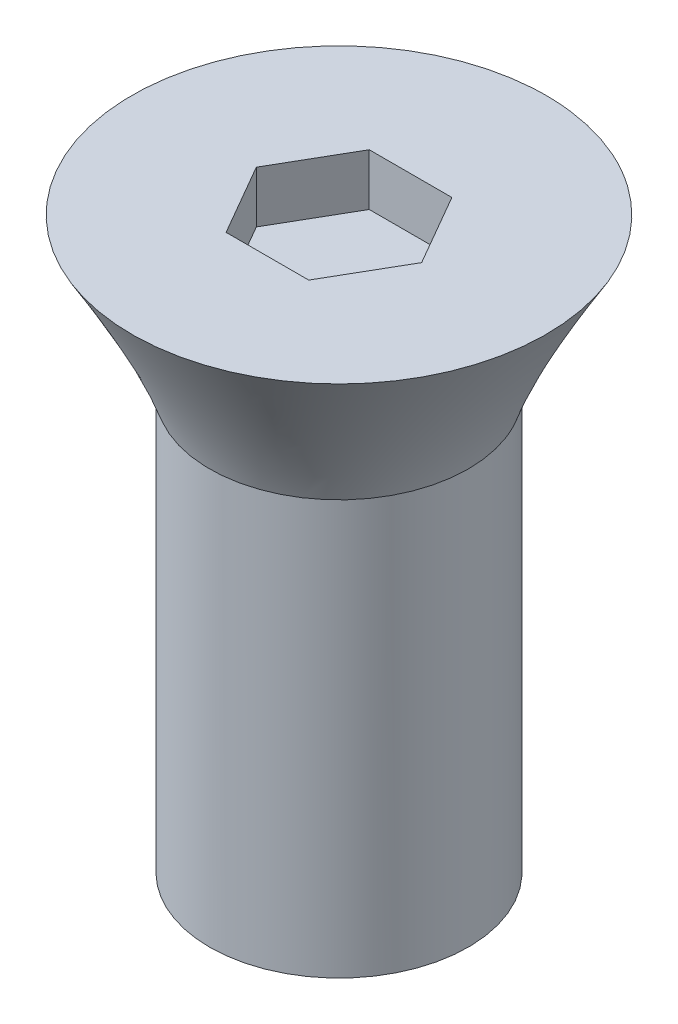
ISO-10303-21;
HEADER;
FILE_DESCRIPTION(('STEP AP214'),'2;1');
FILE_NAME('part.step','',(''),(''),'','','');
FILE_SCHEMA(('AUTOMOTIVE_DESIGN { 1 0 10303 214 1 1 1 1 }'));
ENDSEC;
DATA;
#1=APPLICATION_CONTEXT('core data for automotive mechanical design processes');
#2=APPLICATION_PROTOCOL_DEFINITION('international standard','automotive_design',2000,#1);
#3=PRODUCT_CONTEXT('',#1,'mechanical');
#4=PRODUCT('Part','Part','',(#3));
#5=PRODUCT_RELATED_PRODUCT_CATEGORY('part','',(#4));
#6=PRODUCT_DEFINITION_FORMATION('','',#4);
#7=PRODUCT_DEFINITION_CONTEXT('part definition',#1,'design');
#8=PRODUCT_DEFINITION('design','',#6,#7);
#9=PRODUCT_DEFINITION_SHAPE('','',#8);
#10=(LENGTH_UNIT() NAMED_UNIT(*) SI_UNIT(.MILLI.,.METRE.));
#11=(NAMED_UNIT(*) PLANE_ANGLE_UNIT() SI_UNIT($,.RADIAN.));
#12=(NAMED_UNIT(*) SI_UNIT($,.STERADIAN.) SOLID_ANGLE_UNIT());
#13=UNCERTAINTY_MEASURE_WITH_UNIT(LENGTH_MEASURE(1.E-05),#10,'distance_accuracy_value','');
#14=(GEOMETRIC_REPRESENTATION_CONTEXT(3) GLOBAL_UNCERTAINTY_ASSIGNED_CONTEXT((#13)) GLOBAL_UNIT_ASSIGNED_CONTEXT((#10,
#11,#12)) REPRESENTATION_CONTEXT('',''));
#15=CARTESIAN_POINT('',(0.,0.,0.));
#16=DIRECTION('',(0.,0.,1.));
#17=DIRECTION('',(1.,0.,0.));
#18=AXIS2_PLACEMENT_3D('',#15,#16,#17);
#19=CARTESIAN_POINT('',(4.44089209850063E-13,7.99999999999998,2.22044604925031E-13));
#20=DIRECTION('',(0.,-1.,0.));
#21=DIRECTION('',(0.,0.,-1.));
#22=AXIS2_PLACEMENT_3D('',#19,#20,#21);
#23=CYLINDRICAL_SURFACE('',#22,2.5);
#24=CARTESIAN_POINT('',(4.44089209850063E-13,7.99999999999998,2.22044604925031E-13));
#25=DIRECTION('',(0.,-1.,0.));
#26=DIRECTION('',(0.,0.,-1.));
#27=AXIS2_PLACEMENT_3D('',#24,#25,#26);
#28=CIRCLE('',#27,2.5);
#29=CARTESIAN_POINT('',(-1.74541354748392,7.99999999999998,1.78984120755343));
#30=VERTEX_POINT('',#29);
#31=EDGE_CURVE('E14',#30,#30,#28,.F.);
#32=ORIENTED_EDGE('',*,*,#31,.F.);
#33=EDGE_LOOP('',(#32));
#34=FACE_BOUND('',#33,.T.);
#35=CARTESIAN_POINT('',(0.,0.,0.));
#36=DIRECTION('',(0.,1.,0.));
#37=DIRECTION('',(0.,0.,1.));
#38=AXIS2_PLACEMENT_3D('',#35,#36,#37);
#39=CIRCLE('',#38,2.5);
#40=CARTESIAN_POINT('',(0.,0.,2.50000000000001));
#41=VERTEX_POINT('',#40);
#42=EDGE_CURVE('E58',#41,#41,#39,.T.);
#43=ORIENTED_EDGE('',*,*,#42,.T.);
#44=EDGE_LOOP('',(#43));
#45=FACE_BOUND('',#44,.T.);
#46=ADVANCED_FACE('F50',(#34,#45),#23,.T.);
#47=CARTESIAN_POINT('',(0.,0.,0.));
#48=DIRECTION('',(0.,1.,0.));
#49=DIRECTION('',(0.,0.,1.));
#50=AXIS2_PLACEMENT_3D('',#47,#48,#49);
#51=PLANE('',#50);
#52=ORIENTED_EDGE('',*,*,#42,.F.);
#53=EDGE_LOOP('',(#52));
#54=FACE_BOUND('',#53,.T.);
#55=ADVANCED_FACE('F184',(#54),#51,.F.);
#56=CARTESIAN_POINT('',(3.33066907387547E-13,11.,2.22044604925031E-13));
#57=DIRECTION('',(0.,1.,0.));
#58=DIRECTION('',(0.,0.,1.));
#59=AXIS2_PLACEMENT_3D('',#56,#57,#58);
#60=PLANE('',#59);
#61=DIRECTION('',(-0.499999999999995,0.,0.866025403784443));
#62=VECTOR('',#61,1.);
#63=CARTESIAN_POINT('',(-0.798247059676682,11.,-1.38260446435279));
#64=LINE('',#63,#62);
#65=CARTESIAN_POINT('',(-0.798247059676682,11.,-1.38260446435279));
#66=VERTEX_POINT('',#65);
#67=CARTESIAN_POINT('',(-1.59649411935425,11.,8.88178419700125E-13));
#68=VERTEX_POINT('',#67);
#69=EDGE_CURVE('E66',#66,#68,#64,.T.);
#70=ORIENTED_EDGE('',*,*,#69,.F.);
#71=DIRECTION('',(-1.,0.,0.));
#72=VECTOR('',#71,1.);
#73=CARTESIAN_POINT('',(0.798247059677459,11.,-1.38260446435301));
#74=LINE('',#73,#72);
#75=CARTESIAN_POINT('',(0.798247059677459,11.,-1.38260446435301));
#76=VERTEX_POINT('',#75);
#77=EDGE_CURVE('E149',#76,#66,#74,.T.);
#78=ORIENTED_EDGE('',*,*,#77,.F.);
#79=DIRECTION('',(-0.500000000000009,0.,-0.866025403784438));
#80=VECTOR('',#79,1.);
#81=CARTESIAN_POINT('',(1.59649411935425,11.,1.11022302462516E-12));
#82=LINE('',#81,#80);
#83=CARTESIAN_POINT('',(1.59649411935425,11.,1.11022302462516E-12));
#84=VERTEX_POINT('',#83);
#85=EDGE_CURVE('E147',#84,#76,#82,.T.);
#86=ORIENTED_EDGE('',*,*,#85,.F.);
#87=DIRECTION('',(0.499999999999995,0.,-0.866025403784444));
#88=VECTOR('',#87,1.);
#89=CARTESIAN_POINT('',(0.798247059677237,11.,1.38260446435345));
#90=LINE('',#89,#88);
#91=CARTESIAN_POINT('',(0.798247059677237,11.,1.38260446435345));
#92=VERTEX_POINT('',#91);
#93=EDGE_CURVE('E114',#92,#84,#90,.T.);
#94=ORIENTED_EDGE('',*,*,#93,.F.);
#95=DIRECTION('',(1.,0.,0.));
#96=VECTOR('',#95,1.);
#97=CARTESIAN_POINT('',(-0.798247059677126,11.,1.3826044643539));
#98=LINE('',#97,#96);
#99=CARTESIAN_POINT('',(-0.798247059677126,11.,1.3826044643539));
#100=VERTEX_POINT('',#99);
#101=EDGE_CURVE('E143',#100,#92,#98,.T.);
#102=ORIENTED_EDGE('',*,*,#101,.F.);
#103=DIRECTION('',(0.500000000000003,0.,0.866025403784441));
#104=VECTOR('',#103,1.);
#105=CARTESIAN_POINT('',(-1.59649411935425,11.,8.88178419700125E-13));
#106=LINE('',#105,#104);
#107=EDGE_CURVE('E140',#68,#100,#106,.T.);
#108=ORIENTED_EDGE('',*,*,#107,.F.);
#109=EDGE_LOOP('',(#70,#78,#86,#94,#102,#108));
#110=FACE_BOUND('',#109,.T.);
#111=CARTESIAN_POINT('',(3.33066907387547E-13,11.,2.22044604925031E-13));
#112=DIRECTION('',(0.,1.,0.));
#113=DIRECTION('',(0.,0.,1.));
#114=AXIS2_PLACEMENT_3D('',#111,#112,#113);
#115=CIRCLE('',#114,4.);
#116=CARTESIAN_POINT('',(-1.08697120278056,11.,3.84947965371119));
#117=VERTEX_POINT('',#116);
#118=EDGE_CURVE('E153',#117,#117,#115,.T.);
#119=ORIENTED_EDGE('',*,*,#118,.T.);
#120=EDGE_LOOP('',(#119));
#121=FACE_BOUND('',#120,.T.);
#122=ADVANCED_FACE('F180',(#110,#121),#60,.T.);
#123=CARTESIAN_POINT('',(-1.74541354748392,7.99999999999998,1.78984120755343));
#124=CARTESIAN_POINT('',(-1.08697120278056,11.,3.84947965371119));
#125=CARTESIAN_POINT('',(1.8342688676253,7.99999999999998,5.28066830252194));
#126=CARTESIAN_POINT('',(6.61198810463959,11.,6.02342205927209));
#127=CARTESIAN_POINT('',(5.32509596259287,7.99999999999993,1.70098588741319));
#128=CARTESIAN_POINT('',(8.78593051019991,11.,-1.67553724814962));
#129=CARTESIAN_POINT('',(1.74541354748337,7.99999999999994,-1.78984120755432));
#130=CARTESIAN_POINT('',(1.08697120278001,10.9999999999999,-3.84947965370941));
#131=CARTESIAN_POINT('',(-1.83426886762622,7.99999999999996,-5.28066830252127));
#132=CARTESIAN_POINT('',(-6.61198810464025,10.9999999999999,-6.02342205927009));
#133=CARTESIAN_POINT('',(-5.32509596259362,7.99999999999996,-1.70098588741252));
#134=CARTESIAN_POINT('',(-8.78593051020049,11.,1.67553724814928));
#135=CARTESIAN_POINT('',(-1.74541354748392,7.99999999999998,1.78984120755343));
#136=CARTESIAN_POINT('',(-1.08697120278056,11.,3.84947965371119));
#137=(BOUNDED_SURFACE() B_SPLINE_SURFACE(3,1,((#123,#124),(#125,#126),(#127,#128),(#129,#130),
(#131,#132),(#133,#134),(#135,#136)),.UNSPECIFIED.,.T.,.F.,.F.) B_SPLINE_SURFACE_WITH_KNOTS((4,
3,4),(2,2),(0.,0.5,1.),(0.,1.),
.UNSPECIFIED.) GEOMETRIC_REPRESENTATION_ITEM() RATIONAL_B_SPLINE_SURFACE(((1.,1.),
(0.333333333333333,0.333333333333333),(0.333333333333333,0.333333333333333),(1.,1.),
(0.333333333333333,0.333333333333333),(0.333333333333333,0.333333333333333),(1.,1.))) REPRESENTATION_ITEM('') SURFACE());
#138=CARTESIAN_POINT('',(-1.74541354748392,7.99999999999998,1.78984120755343));
#139=CARTESIAN_POINT('',(-1.73855477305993,8.03124999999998,1.81129577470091));
#140=CARTESIAN_POINT('',(-1.73169599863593,8.06249999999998,1.83275034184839));
#141=CARTESIAN_POINT('',(-1.71797844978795,8.12499999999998,1.87565947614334));
#142=CARTESIAN_POINT('',(-1.71111967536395,8.15624999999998,1.89711404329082));
#143=CARTESIAN_POINT('',(-1.69740212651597,8.21874999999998,1.94002317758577));
#144=CARTESIAN_POINT('',(-1.69054335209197,8.24999999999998,1.96147774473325));
#145=CARTESIAN_POINT('',(-1.67682580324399,8.31249999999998,2.0043868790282));
#146=CARTESIAN_POINT('',(-1.66996702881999,8.34374999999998,2.02584144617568));
#147=CARTESIAN_POINT('',(-1.65624947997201,8.40624999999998,2.06875058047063));
#148=CARTESIAN_POINT('',(-1.64939070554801,8.43749999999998,2.09020514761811));
#149=CARTESIAN_POINT('',(-1.63567315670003,8.49999999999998,2.13311428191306));
#150=CARTESIAN_POINT('',(-1.62881438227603,8.53124999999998,2.15456884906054));
#151=CARTESIAN_POINT('',(-1.61509683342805,8.59374999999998,2.19747798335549));
#152=CARTESIAN_POINT('',(-1.60823805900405,8.62499999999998,2.21893255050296));
#153=CARTESIAN_POINT('',(-1.59452051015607,8.68749999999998,2.26184168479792));
#154=CARTESIAN_POINT('',(-1.58766173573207,8.71874999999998,2.28329625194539));
#155=CARTESIAN_POINT('',(-1.57394418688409,8.78124999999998,2.32620538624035));
#156=CARTESIAN_POINT('',(-1.56708541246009,8.81249999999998,2.34765995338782));
#157=CARTESIAN_POINT('',(-1.55336786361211,8.87499999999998,2.39056908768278));
#158=CARTESIAN_POINT('',(-1.54650908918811,8.90624999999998,2.41202365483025));
#159=CARTESIAN_POINT('',(-1.53279154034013,8.96874999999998,2.45493278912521));
#160=CARTESIAN_POINT('',(-1.52593276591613,8.99999999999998,2.47638735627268));
#161=CARTESIAN_POINT('',(-1.51221521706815,9.06249999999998,2.51929649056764));
#162=CARTESIAN_POINT('',(-1.50535644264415,9.09374999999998,2.54075105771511));
#163=CARTESIAN_POINT('',(-1.49163889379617,9.15624999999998,2.58366019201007));
#164=CARTESIAN_POINT('',(-1.48478011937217,9.18749999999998,2.60511475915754));
#165=CARTESIAN_POINT('',(-1.47106257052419,9.24999999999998,2.6480238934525));
#166=CARTESIAN_POINT('',(-1.46420379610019,9.28124999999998,2.66947846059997));
#167=CARTESIAN_POINT('',(-1.45048624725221,9.34374999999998,2.71238759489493));
#168=CARTESIAN_POINT('',(-1.44362747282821,9.37499999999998,2.7338421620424));
#169=CARTESIAN_POINT('',(-1.42990992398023,9.43749999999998,2.77675129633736));
#170=CARTESIAN_POINT('',(-1.42305114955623,9.46874999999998,2.79820586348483));
#171=CARTESIAN_POINT('',(-1.40933360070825,9.53124999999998,2.84111499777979));
#172=CARTESIAN_POINT('',(-1.40247482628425,9.56249999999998,2.86256956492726));
#173=CARTESIAN_POINT('',(-1.38875727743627,9.62499999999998,2.90547869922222));
#174=CARTESIAN_POINT('',(-1.38189850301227,9.65624999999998,2.92693326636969));
#175=CARTESIAN_POINT('',(-1.36818095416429,9.71874999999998,2.96984240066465));
#176=CARTESIAN_POINT('',(-1.36132217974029,9.74999999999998,2.99129696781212));
#177=CARTESIAN_POINT('',(-1.34760463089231,9.81249999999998,3.03420610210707));
#178=CARTESIAN_POINT('',(-1.34074585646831,9.84374999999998,3.05566066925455));
#179=CARTESIAN_POINT('',(-1.32702830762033,9.90624999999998,3.09856980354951));
#180=CARTESIAN_POINT('',(-1.32016953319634,9.93749999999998,3.12002437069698));
#181=CARTESIAN_POINT('',(-1.30645198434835,9.99999999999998,3.16293350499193));
#182=CARTESIAN_POINT('',(-1.29959320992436,10.03125,3.18438807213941));
#183=CARTESIAN_POINT('',(-1.28587566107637,10.09375,3.22729720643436));
#184=CARTESIAN_POINT('',(-1.27901688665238,10.125,3.24875177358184));
#185=CARTESIAN_POINT('',(-1.26529933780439,10.1875,3.29166090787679));
#186=CARTESIAN_POINT('',(-1.2584405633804,10.21875,3.31311547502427));
#187=CARTESIAN_POINT('',(-1.24472301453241,10.28125,3.35602460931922));
#188=CARTESIAN_POINT('',(-1.23786424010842,10.3125,3.3774791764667));
#189=CARTESIAN_POINT('',(-1.22414669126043,10.375,3.42038831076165));
#190=CARTESIAN_POINT('',(-1.21728791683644,10.40625,3.44184287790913));
#191=CARTESIAN_POINT('',(-1.20357036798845,10.46875,3.48475201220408));
#192=CARTESIAN_POINT('',(-1.19671159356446,10.5,3.50620657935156));
#193=CARTESIAN_POINT('',(-1.18299404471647,10.5625,3.54911571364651));
#194=CARTESIAN_POINT('',(-1.17613527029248,10.59375,3.57057028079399));
#195=CARTESIAN_POINT('',(-1.16241772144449,10.65625,3.61347941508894));
#196=CARTESIAN_POINT('',(-1.1555589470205,10.6875,3.63493398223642));
#197=CARTESIAN_POINT('',(-1.14184139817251,10.75,3.67784311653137));
#198=CARTESIAN_POINT('',(-1.13498262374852,10.78125,3.69929768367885));
#199=CARTESIAN_POINT('',(-1.12126507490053,10.84375,3.7422068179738));
#200=CARTESIAN_POINT('',(-1.11440630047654,10.875,3.76366138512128));
#201=CARTESIAN_POINT('',(-1.10068875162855,10.9375,3.80657051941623));
#202=CARTESIAN_POINT('',(-1.09382997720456,10.96875,3.82802508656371));
#203=CARTESIAN_POINT('',(-1.08697120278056,11.,3.84947965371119));
#204=B_SPLINE_CURVE_WITH_KNOTS('',3,(#138,#139,#140,#141,#142,#143,#144,#145,#146,#147,#148,
#149,#150,#151,#152,#153,#154,#155,#156,#157,#158,#159,#160,#161,#162,#163,#164,#165,#166,#167,
#168,#169,#170,#171,#172,#173,#174,#175,#176,#177,#178,#179,#180,#181,#182,#183,#184,#185,#186,
#187,#188,#189,#190,#191,#192,#193,#194,#195,#196,#197,#198,#199,#200,#201,#202,#203),
.UNSPECIFIED.,.F.,.F.,(4,2,2,2,2,2,2,2,2,2,2,2,2,2,2,2,2,2,2,2,2,2,2,2,2,2,2,2,2,2,2,2,4),(0.,
0.115564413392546,0.231128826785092,0.346693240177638,0.462257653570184,0.57782206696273,
0.693386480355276,0.808950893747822,0.924515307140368,1.04007972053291,1.15564413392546,
1.27120854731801,1.38677296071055,1.5023373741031,1.61790178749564,1.73346620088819,
1.84903061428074,1.96459502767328,2.08015944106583,2.19572385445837,2.31128826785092,
2.42685268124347,2.54241709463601,2.65798150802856,2.77354592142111,2.88911033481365,
3.0046747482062,3.12023916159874,3.23580357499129,3.35136798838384,3.46693240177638,
3.58249681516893,3.69806122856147),.UNSPECIFIED.);
#205=EDGE_CURVE('BSEAM168',#30,#117,#204,.T.);
#206=ORIENTED_EDGE('',*,*,#31,.T.);
#207=ORIENTED_EDGE('',*,*,#118,.F.);
#208=ORIENTED_EDGE('',*,*,#205,.T.);
#209=ORIENTED_EDGE('',*,*,#205,.F.);
#210=EDGE_LOOP('',(#206,#208,#207,#209));
#211=FACE_BOUND('',#210,.T.);
#212=ADVANCED_FACE('F168',(#211),#137,.T.);
#213=CARTESIAN_POINT('',(-0.798247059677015,9.99999999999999,-1.38260446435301));
#214=DIRECTION('',(-0.866025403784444,0.,-0.499999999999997));
#215=DIRECTION('',(-0.499999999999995,0.,0.866025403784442));
#216=AXIS2_PLACEMENT_3D('',#213,#214,#215);
#217=PLANE('',#216);
#218=ORIENTED_EDGE('',*,*,#69,.T.);
#219=DIRECTION('',(0.,1.,0.));
#220=VECTOR('',#219,1.);
#221=CARTESIAN_POINT('',(-1.59649411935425,10.,4.44089209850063E-13));
#222=LINE('',#221,#220);
#223=CARTESIAN_POINT('',(-1.59649411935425,10.,4.44089209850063E-13));
#224=VERTEX_POINT('',#223);
#225=EDGE_CURVE('E96',#224,#68,#222,.T.);
#226=ORIENTED_EDGE('',*,*,#225,.F.);
#227=DIRECTION('',(-0.499999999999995,0.,0.866025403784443));
#228=VECTOR('',#227,1.);
#229=CARTESIAN_POINT('',(-0.798247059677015,9.99999999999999,-1.38260446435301));
#230=LINE('',#229,#228);
#231=CARTESIAN_POINT('',(-0.798247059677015,9.99999999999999,-1.38260446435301));
#232=VERTEX_POINT('',#231);
#233=EDGE_CURVE('E151',#232,#224,#230,.T.);
#234=ORIENTED_EDGE('',*,*,#233,.F.);
#235=DIRECTION('',(0.,1.,0.));
#236=VECTOR('',#235,1.);
#237=CARTESIAN_POINT('',(-0.798247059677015,9.99999999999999,-1.38260446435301));
#238=LINE('',#237,#236);
#239=EDGE_CURVE('E74',#232,#66,#238,.T.);
#240=ORIENTED_EDGE('',*,*,#239,.T.);
#241=EDGE_LOOP('',(#218,#226,#234,#240));
#242=FACE_BOUND('',#241,.T.);
#243=ADVANCED_FACE('F179',(#242),#217,.F.);
#244=CARTESIAN_POINT('',(0.798247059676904,9.99999999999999,-1.38260446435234));
#245=DIRECTION('',(0.,0.,-1.));
#246=DIRECTION('',(-1.,0.,0.));
#247=AXIS2_PLACEMENT_3D('',#244,#245,#246);
#248=PLANE('',#247);
#249=ORIENTED_EDGE('',*,*,#77,.T.);
#250=ORIENTED_EDGE('',*,*,#239,.F.);
#251=DIRECTION('',(-1.,0.,0.));
#252=VECTOR('',#251,1.);
#253=CARTESIAN_POINT('',(0.798247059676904,9.99999999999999,-1.38260446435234));
#254=LINE('',#253,#252);
#255=CARTESIAN_POINT('',(0.798247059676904,9.99999999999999,-1.38260446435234));
#256=VERTEX_POINT('',#255);
#257=EDGE_CURVE('E126',#256,#232,#254,.T.);
#258=ORIENTED_EDGE('',*,*,#257,.F.);
#259=DIRECTION('',(0.,1.,0.));
#260=VECTOR('',#259,1.);
#261=CARTESIAN_POINT('',(0.798247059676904,9.99999999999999,-1.38260446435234));
#262=LINE('',#261,#260);
#263=EDGE_CURVE('E118',#256,#76,#262,.T.);
#264=ORIENTED_EDGE('',*,*,#263,.T.);
#265=EDGE_LOOP('',(#249,#250,#258,#264));
#266=FACE_BOUND('',#265,.T.);
#267=ADVANCED_FACE('F232',(#266),#248,.F.);
#268=CARTESIAN_POINT('',(1.59649411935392,9.99999999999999,2.22044604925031E-13));
#269=DIRECTION('',(0.866025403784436,0.,-0.500000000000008));
#270=DIRECTION('',(-0.500000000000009,0.,-0.866025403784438));
#271=AXIS2_PLACEMENT_3D('',#268,#269,#270);
#272=PLANE('',#271);
#273=ORIENTED_EDGE('',*,*,#85,.T.);
#274=ORIENTED_EDGE('',*,*,#263,.F.);
#275=DIRECTION('',(-0.500000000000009,0.,-0.866025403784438));
#276=VECTOR('',#275,1.);
#277=CARTESIAN_POINT('',(1.59649411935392,9.99999999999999,2.22044604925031E-13));
#278=LINE('',#277,#276);
#279=CARTESIAN_POINT('',(1.59649411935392,9.99999999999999,2.22044604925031E-13));
#280=VERTEX_POINT('',#279);
#281=EDGE_CURVE('E122',#280,#256,#278,.T.);
#282=ORIENTED_EDGE('',*,*,#281,.F.);
#283=DIRECTION('',(0.,1.,0.));
#284=VECTOR('',#283,1.);
#285=CARTESIAN_POINT('',(1.59649411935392,9.99999999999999,2.22044604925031E-13));
#286=LINE('',#285,#284);
#287=EDGE_CURVE('E107',#280,#84,#286,.T.);
#288=ORIENTED_EDGE('',*,*,#287,.T.);
#289=EDGE_LOOP('',(#273,#274,#282,#288));
#290=FACE_BOUND('',#289,.T.);
#291=ADVANCED_FACE('F123',(#290),#272,.F.);
#292=CARTESIAN_POINT('',(0.798247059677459,9.99999999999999,1.38260446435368));
#293=DIRECTION('',(0.866025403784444,0.,0.499999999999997));
#294=DIRECTION('',(0.499999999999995,0.,-0.866025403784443));
#295=AXIS2_PLACEMENT_3D('',#292,#293,#294);
#296=PLANE('',#295);
#297=ORIENTED_EDGE('',*,*,#93,.T.);
#298=ORIENTED_EDGE('',*,*,#287,.F.);
#299=DIRECTION('',(0.499999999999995,0.,-0.866025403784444));
#300=VECTOR('',#299,1.);
#301=CARTESIAN_POINT('',(0.798247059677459,9.99999999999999,1.38260446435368));
#302=LINE('',#301,#300);
#303=CARTESIAN_POINT('',(0.798247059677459,9.99999999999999,1.38260446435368));
#304=VERTEX_POINT('',#303);
#305=EDGE_CURVE('E111',#304,#280,#302,.T.);
#306=ORIENTED_EDGE('',*,*,#305,.F.);
#307=DIRECTION('',(0.,1.,0.));
#308=VECTOR('',#307,1.);
#309=CARTESIAN_POINT('',(0.798247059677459,9.99999999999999,1.38260446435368));
#310=LINE('',#309,#308);
#311=EDGE_CURVE('E119',#304,#92,#310,.T.);
#312=ORIENTED_EDGE('',*,*,#311,.T.);
#313=EDGE_LOOP('',(#297,#298,#306,#312));
#314=FACE_BOUND('',#313,.T.);
#315=ADVANCED_FACE('F109',(#314),#296,.F.);
#316=CARTESIAN_POINT('',(-0.79824705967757,9.99999999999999,1.38260446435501));
#317=DIRECTION('',(0.,0.,1.));
#318=DIRECTION('',(1.,0.,0.));
#319=AXIS2_PLACEMENT_3D('',#316,#317,#318);
#320=PLANE('',#319);
#321=ORIENTED_EDGE('',*,*,#101,.T.);
#322=ORIENTED_EDGE('',*,*,#311,.F.);
#323=DIRECTION('',(1.,0.,0.));
#324=VECTOR('',#323,1.);
#325=CARTESIAN_POINT('',(-0.79824705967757,9.99999999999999,1.38260446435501));
#326=LINE('',#325,#324);
#327=CARTESIAN_POINT('',(-0.79824705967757,9.99999999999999,1.38260446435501));
#328=VERTEX_POINT('',#327);
#329=EDGE_CURVE('E132',#328,#304,#326,.T.);
#330=ORIENTED_EDGE('',*,*,#329,.F.);
#331=DIRECTION('',(0.,1.,0.));
#332=VECTOR('',#331,1.);
#333=CARTESIAN_POINT('',(-0.79824705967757,9.99999999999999,1.38260446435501));
#334=LINE('',#333,#332);
#335=EDGE_CURVE('E156',#328,#100,#334,.T.);
#336=ORIENTED_EDGE('',*,*,#335,.T.);
#337=EDGE_LOOP('',(#321,#322,#330,#336));
#338=FACE_BOUND('',#337,.T.);
#339=ADVANCED_FACE('F250',(#338),#320,.F.);
#340=CARTESIAN_POINT('',(-1.59649411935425,10.,4.44089209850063E-13));
#341=DIRECTION('',(-0.866025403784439,0.,0.500000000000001));
#342=DIRECTION('',(0.500000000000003,0.,0.866025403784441));
#343=AXIS2_PLACEMENT_3D('',#340,#341,#342);
#344=PLANE('',#343);
#345=ORIENTED_EDGE('',*,*,#107,.T.);
#346=ORIENTED_EDGE('',*,*,#335,.F.);
#347=DIRECTION('',(0.500000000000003,0.,0.866025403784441));
#348=VECTOR('',#347,1.);
#349=CARTESIAN_POINT('',(-1.59649411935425,10.,4.44089209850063E-13));
#350=LINE('',#349,#348);
#351=EDGE_CURVE('E134',#224,#328,#350,.T.);
#352=ORIENTED_EDGE('',*,*,#351,.F.);
#353=ORIENTED_EDGE('',*,*,#225,.T.);
#354=EDGE_LOOP('',(#345,#346,#352,#353));
#355=FACE_BOUND('',#354,.T.);
#356=ADVANCED_FACE('F257',(#355),#344,.F.);
#357=CARTESIAN_POINT('',(2.22044604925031E-13,10.,2.22044604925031E-13));
#358=DIRECTION('',(0.,1.,0.));
#359=DIRECTION('',(0.,0.,1.));
#360=AXIS2_PLACEMENT_3D('',#357,#358,#359);
#361=PLANE('',#360);
#362=ORIENTED_EDGE('',*,*,#233,.T.);
#363=ORIENTED_EDGE('',*,*,#351,.T.);
#364=ORIENTED_EDGE('',*,*,#329,.T.);
#365=ORIENTED_EDGE('',*,*,#305,.T.);
#366=ORIENTED_EDGE('',*,*,#281,.T.);
#367=ORIENTED_EDGE('',*,*,#257,.T.);
#368=EDGE_LOOP('',(#362,#363,#364,#365,#366,#367));
#369=FACE_BOUND('',#368,.T.);
#370=ADVANCED_FACE('F129',(#369),#361,.T.);
#371=CLOSED_SHELL('',(#46,#55,#122,#212,#243,#267,#291,#315,#339,#356,#370));
#372=MANIFOLD_SOLID_BREP('B2',#371);
#373=ADVANCED_BREP_SHAPE_REPRESENTATION('',(#18,#372),#14);
#374=SHAPE_DEFINITION_REPRESENTATION(#9,#373);
ENDSEC;
END-ISO-10303-21;
